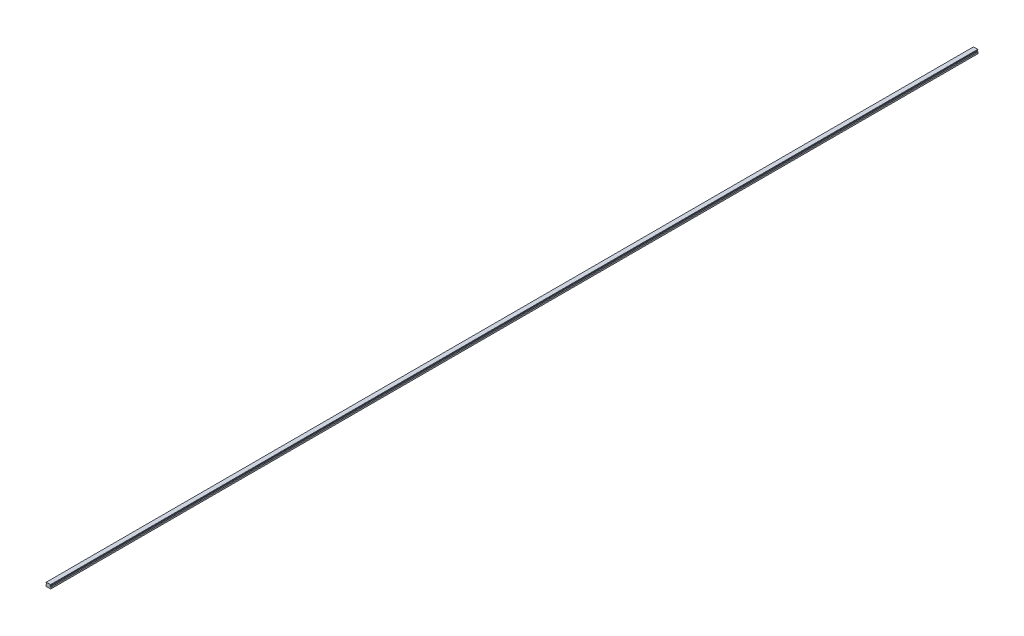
from build123d import *

# Parameters (mm, degrees)
SKETCH1_W           = 20
SKETCH1_H           = 16.3
BOSS_EXTRUDE1_DEPTH = 1940
CUT_EXTRUDE1_DEPTH  = 3881.047124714
CHAMFER1_SIZE       = 1
FILLET1_R           = 1
CUT_EXTRUDE2_DEPTH  = 3881.047124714
SKETCH5_R           = 3
SKETCH5_R_2         = 2.5
CUT_EXTRUDE5_DEPTH  = 10
SKETCH5_2_R         = 2.5
CUT_EXTRUDE6_DEPTH  = 13
LPATTERN2_COUNT     = 65
LPATTERN2_PITCH     = 60


with BuildPart() as part:
    # Sketch1 → Boss-Extrude1 (new, symmetric)
    with BuildSketch(Plane.XY):
        with Locations((0, 8.15)):
            Rectangle(SKETCH1_W, SKETCH1_H)
    extrude(amount=BOSS_EXTRUDE1_DEPTH, both=True)

    # Sketch2 → Cut-Extrude1 (cut, through all)
    with BuildSketch(Plane.XY.offset(1940)):
        Polygon((-10, 14.3), (-10, 7.3), (-7.666666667, 9.633333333), (-7.666666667, 11.966666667), align=None)
        Polygon((7.666666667, 11.966666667), (10, 14.3), (10, 7.3), (7.666666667, 9.633333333), align=None)
    extrude(amount=-CUT_EXTRUDE1_DEPTH, mode=Mode.SUBTRACT)

    # Chamfer1
    chamfer1_edges = [part.edges().sort_by_distance(p)[0] for p in [
        (-10, 16.3, 0),
        (10, 16.3, 0),
        (10, 0, 0),
        (-10, 0, 0),
    ]]
    chamfer(chamfer1_edges, length=CHAMFER1_SIZE)

    # Fillet1
    fillet1_edges = [part.edges().sort_by_distance(p)[0] for p in [
        (-7.666666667, 11.966666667, 0),
        (-7.666666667, 9.633333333, 0),
        (7.666666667, 9.633333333, 0),
        (7.666666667, 11.966666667, 0),
    ]]
    fillet(fillet1_edges, radius=FILLET1_R)

    # Sketch3 → Cut-Extrude2 (cut, through all)
    with BuildSketch(Plane.XY.offset(1940)):
        Polygon((-6, 0), (-5, 1), (5, 1), (6, 0), align=None)
    extrude(amount=-CUT_EXTRUDE2_DEPTH, mode=Mode.SUBTRACT)

    # Sketch5 → Cut-Extrude5 (cut)
    with BuildSketch(Plane.XZ.offset(-1)):
        with Locations(Location((0, 1920, 0), (0, 0, 270))):
            Circle(SKETCH5_R)
        with Locations(Location((0, 1920, 0), (0, 0, 270))):
            Circle(SKETCH5_R_2, mode=Mode.SUBTRACT)
    cut_extrude5 = extrude(amount=-CUT_EXTRUDE5_DEPTH, mode=Mode.SUBTRACT)

    # Sketch5_2 → Cut-Extrude6 (cut)
    with BuildSketch(Plane.XZ.offset(-1)):
        with Locations(Location((0, 1920, 0), (0, 0, 270))):
            Circle(SKETCH5_2_R)
    cut_extrude6 = extrude(amount=-CUT_EXTRUDE6_DEPTH, mode=Mode.SUBTRACT)

    # Cut-Extrude7 cone 1 section (on through the dimple's axis) → Cut-Extrude7 (revolve, cut)
    with BuildSketch(Plane(origin=(0, 14, 1920), x_dir=(0, 0, -1), z_dir=(1, 0, 0))):
        Polygon((0, 0), (2.5, 0), (0, 1.443375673), align=None)
    cut_extrude7 = revolve(axis=Axis((0, 14, 1920), (0, 1, 0)), mode=Mode.SUBTRACT)

    # LPattern2: Cut-Extrude5, Cut-Extrude6, Cut-Extrude7 ×65
    with Locations(*[(0, 0, -i * LPATTERN2_PITCH) for i in range(1, LPATTERN2_COUNT)]):
        add(cut_extrude5, mode=Mode.SUBTRACT)
        add(cut_extrude6, mode=Mode.SUBTRACT)
        add(cut_extrude7, mode=Mode.SUBTRACT)


solid = part.part
